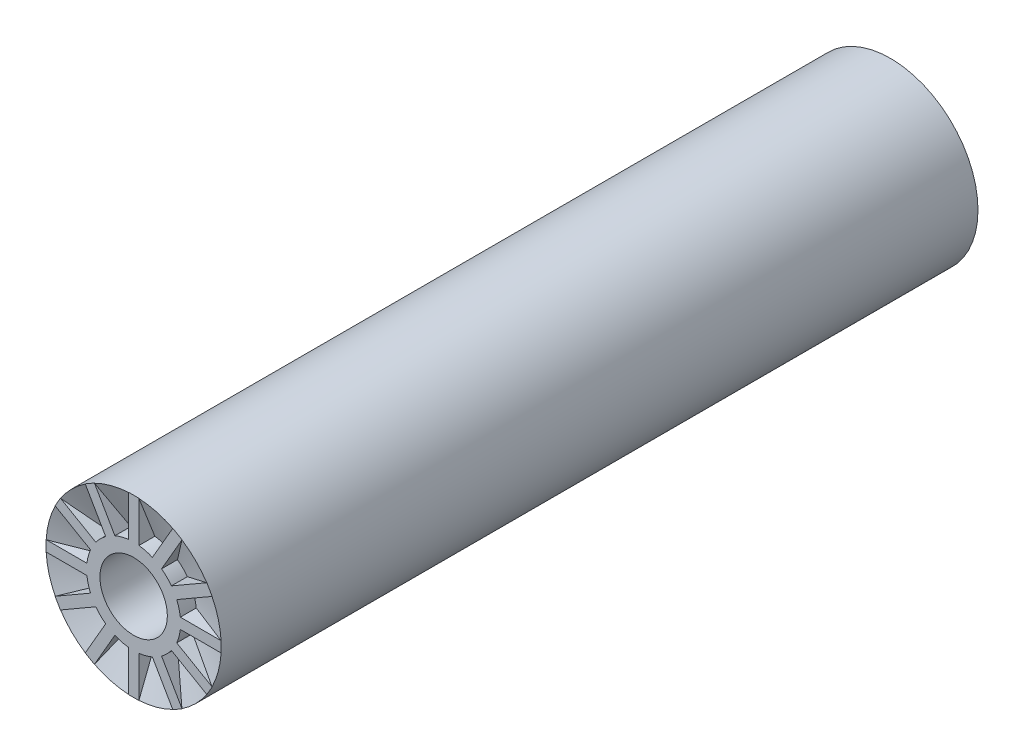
from build123d import *

# Parameters (mm, degrees)
BOSS_EXTRUDE1_DEPTH = 1
CIRPATTERN1_COUNT   = 12


with BuildPart() as part:
    # Sketch1 → Revolve1 (revolve)
    with BuildSketch(Plane(origin=(0, 0, 0), x_dir=(0, 0, -1), z_dir=(1, 0, 0)), mode=Mode.PRIVATE) as revolve1_sk:
        Polygon((0, 6.35), (-10, 6.35), (-10, 8.85), (-7, 8.85), (-10, 16.5), (132.5, 16.5), (132.5, 8), (129.5, 8), (122.945355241, 13.5), (-4.65, 13.5), (0, 8.85), align=None)
    revolve(revolve1_sk.sketch.rotate(Axis((0, 0, 10), (0, 0, -1)), 90), axis=Axis((0, 0, 10), (0, 0, -1)))

    # Sketch2 → Boss-Extrude1 (add, symmetric)
    with BuildSketch(Plane(origin=(0, 0, 0), x_dir=(1, 0, 0), z_dir=(0, 1, 0))):
        Polygon((16.5, -10), (8.008321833, -10), (8.008321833, -5.830849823), align=None)
    boss_extrude1 = extrude(amount=BOSS_EXTRUDE1_DEPTH, both=True)

    # CirPattern1: Boss-Extrude1 ×12 about axis
    cirpattern1_axis = Axis((0, 0, 0), (0, 0, 1))
    for i in range(1, CIRPATTERN1_COUNT):
        add(boss_extrude1.rotate(cirpattern1_axis, i * 360 / CIRPATTERN1_COUNT))


solid = part.part
